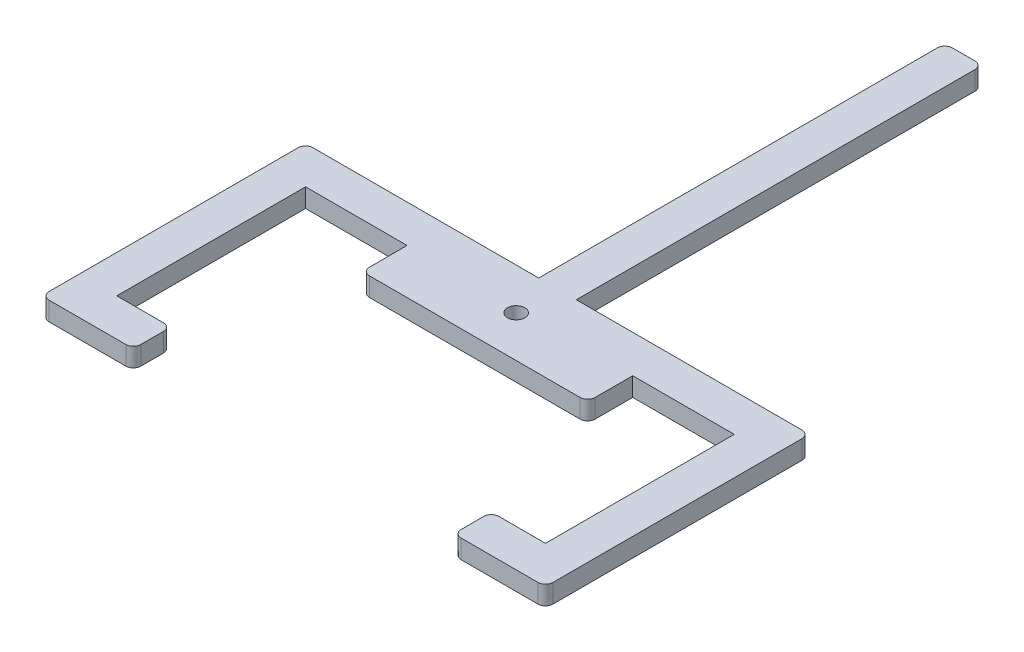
from build123d import *

# Parameters (mm, degrees)
BOSS_EXTRUDE1_DEPTH   = 3.175
SKETCH2_W             = 15.494
SKETCH2_H             = 6.35
BOSS_EXTRUDE2_DEPTH   = 3.175
F_4_CLEARANCE_HOLE1_D = 2.9464
SKETCH5_W             = 15.875
SKETCH5_H             = 4.445
BOSS_EXTRUDE3_DEPTH   = 3.175
FILLET1_R             = 1.27


with BuildPart() as part:
    # Sketch1 → Boss-Extrude1 (new body)
    with BuildSketch(Plane(origin=(0, 0, 0), x_dir=(1, 0, 0), z_dir=(0, 1, 0))):
        Polygon((0, 0), (0, -68.58), (-39.37, -68.58), (-39.37, -109.982), (-33.02, -109.982), (-33.02, -74.93), (0, -74.93), (0, -79.375), (-15.875, -79.375), (-15.875, -82.55), (22.225, -82.55), (22.225, -79.375), (6.35, -79.375), (6.35, -74.93), (39.37, -74.93), (39.37, -109.982), (45.72, -109.982), (45.72, -68.58), (6.35, -68.58), (6.35, 0), align=None)
    extrude(amount=BOSS_EXTRUDE1_DEPTH)

    # Sketch2 → Boss-Extrude2 (add)
    with BuildSketch(Plane(origin=(0, 0, 0), x_dir=(1, 0, 0), z_dir=(0, 1, 0))):
        with Locations((-31.623, -109.982)):
            Rectangle(SKETCH2_W, SKETCH2_H)
        with Locations((37.973, -109.982)):
            Rectangle(SKETCH2_W, SKETCH2_H)
    extrude(amount=BOSS_EXTRUDE2_DEPTH)

    # 4 Clearance Hole1 (through all)
    with Locations(Plane(origin=(0, 3.175, 0), x_dir=(1, 0, 0), z_dir=(0, 1, 0))):
        with Locations((3.175, -75.565)):
            Hole(F_4_CLEARANCE_HOLE1_D / 2)

    # Sketch5 → Boss-Extrude3 (add)
    with BuildSketch(Plane(origin=(0, 0, 0), x_dir=(1, 0, 0), z_dir=(0, 1, 0))):
        with Locations((-7.9375, -77.1525)):
            Rectangle(SKETCH5_W, SKETCH5_H)
        with Locations((14.2875, -77.1525)):
            Rectangle(SKETCH5_W, SKETCH5_H)
    extrude(amount=BOSS_EXTRUDE3_DEPTH)

    # Fillet1
    fillet1_edges = [part.edges().sort_by_distance(p)[0] for p in [
        (6.35, 1.5875, 0),
        (45.72, 1.5875, 68.58),
        (22.225, 1.5875, 82.55),
        (-15.875, 1.5875, 82.55),
        (-39.37, 1.5875, 68.58),
        (0, 1.5875, 0),
        (-23.876, 1.5875, 106.807),
        (-39.37, 1.5875, 113.157),
        (-23.876, 1.5875, 113.157),
        (45.72, 1.5875, 113.157),
        (30.226, 1.5875, 106.807),
        (30.226, 1.5875, 113.157),
    ]]
    fillet(fillet1_edges, radius=FILLET1_R)


solid = part.part
